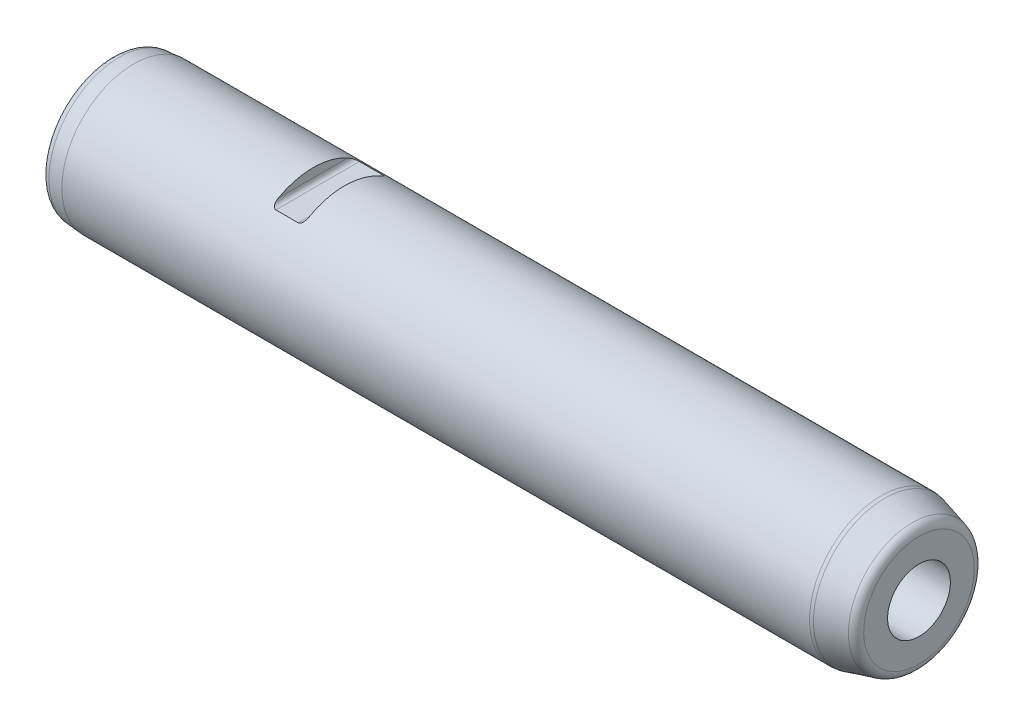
ISO-10303-21;
HEADER;
FILE_DESCRIPTION(('STEP AP214'),'2;1');
FILE_NAME('part.step','',(''),(''),'','','');
FILE_SCHEMA(('AUTOMOTIVE_DESIGN { 1 0 10303 214 1 1 1 1 }'));
ENDSEC;
DATA;
#1=APPLICATION_CONTEXT('core data for automotive mechanical design processes');
#2=APPLICATION_PROTOCOL_DEFINITION('international standard','automotive_design',2000,#1);
#3=PRODUCT_CONTEXT('',#1,'mechanical');
#4=PRODUCT('Part','Part','',(#3));
#5=PRODUCT_RELATED_PRODUCT_CATEGORY('part','',(#4));
#6=PRODUCT_DEFINITION_FORMATION('','',#4);
#7=PRODUCT_DEFINITION_CONTEXT('part definition',#1,'design');
#8=PRODUCT_DEFINITION('design','',#6,#7);
#9=PRODUCT_DEFINITION_SHAPE('','',#8);
#10=(LENGTH_UNIT() NAMED_UNIT(*) SI_UNIT(.MILLI.,.METRE.));
#11=(NAMED_UNIT(*) PLANE_ANGLE_UNIT() SI_UNIT($,.RADIAN.));
#12=(NAMED_UNIT(*) SI_UNIT($,.STERADIAN.) SOLID_ANGLE_UNIT());
#13=UNCERTAINTY_MEASURE_WITH_UNIT(LENGTH_MEASURE(1.E-05),#10,'distance_accuracy_value','');
#14=(GEOMETRIC_REPRESENTATION_CONTEXT(3) GLOBAL_UNCERTAINTY_ASSIGNED_CONTEXT((#13)) GLOBAL_UNIT_ASSIGNED_CONTEXT((#10,
#11,#12)) REPRESENTATION_CONTEXT('',''));
#15=CARTESIAN_POINT('',(0.,0.,0.));
#16=DIRECTION('',(0.,0.,1.));
#17=DIRECTION('',(1.,0.,0.));
#18=AXIS2_PLACEMENT_3D('',#15,#16,#17);
#19=CARTESIAN_POINT('',(0.,0.,0.));
#20=DIRECTION('',(1.,0.,0.));
#21=DIRECTION('',(0.,0.,-1.));
#22=AXIS2_PLACEMENT_3D('',#19,#20,#21);
#23=PLANE('',#22);
#24=CARTESIAN_POINT('',(0.,0.,0.));
#25=DIRECTION('',(1.,0.,0.));
#26=DIRECTION('',(0.,0.,-1.));
#27=AXIS2_PLACEMENT_3D('',#24,#25,#26);
#28=CIRCLE('',#27,13.7298943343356);
#29=CARTESIAN_POINT('',(0.,0.,-13.7298943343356));
#30=VERTEX_POINT('',#29);
#31=EDGE_CURVE('E158',#30,#30,#28,.F.);
#32=ORIENTED_EDGE('',*,*,#31,.T.);
#33=EDGE_LOOP('',(#32));
#34=FACE_BOUND('',#33,.T.);
#35=ADVANCED_FACE('F15',(#34),#23,.F.);
#36=CARTESIAN_POINT('',(0.,0.,0.));
#37=DIRECTION('',(-1.,0.,0.));
#38=DIRECTION('',(0.,0.,1.));
#39=AXIS2_PLACEMENT_3D('',#36,#37,#38);
#40=CYLINDRICAL_SURFACE('',#39,16.);
#41=CARTESIAN_POINT('',(52.,0.,0.));
#42=DIRECTION('',(1.,0.,0.));
#43=DIRECTION('',(0.,1.,0.));
#44=AXIS2_PLACEMENT_3D('',#41,#42,#43);
#45=CIRCLE('',#44,16.);
#46=CARTESIAN_POINT('',(52.,14.,-7.74596669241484));
#47=VERTEX_POINT('',#46);
#48=CARTESIAN_POINT('',(52.,14.,7.74596669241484));
#49=VERTEX_POINT('',#48);
#50=EDGE_CURVE('E9',#47,#49,#45,.T.);
#51=ORIENTED_EDGE('',*,*,#50,.T.);
#52=CARTESIAN_POINT('',(52.,14.,7.74596669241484));
#53=CARTESIAN_POINT('',(51.9999650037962,13.959348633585,7.819449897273));
#54=CARTESIAN_POINT('',(51.9975167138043,13.9180874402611,7.89264943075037));
#55=CARTESIAN_POINT('',(51.9871135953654,13.8344399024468,8.03836515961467));
#56=CARTESIAN_POINT('',(51.9791381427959,13.7920499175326,8.11087776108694));
#57=CARTESIAN_POINT('',(51.9569051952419,13.7062168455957,8.25510297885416));
#58=CARTESIAN_POINT('',(51.9425995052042,13.662768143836,8.32680504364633));
#59=CARTESIAN_POINT('',(51.9067194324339,13.5756417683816,8.46810565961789));
#60=CARTESIAN_POINT('',(51.8851577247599,13.531964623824,8.53770764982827));
#61=CARTESIAN_POINT('',(51.8398944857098,13.4559301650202,8.65688275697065));
#62=CARTESIAN_POINT('',(51.8180806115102,13.4234768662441,8.70710713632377));
#63=CARTESIAN_POINT('',(51.7688619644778,13.3593077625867,8.80524414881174));
#64=CARTESIAN_POINT('',(51.741460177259,13.3275915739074,8.8531579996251));
#65=CARTESIAN_POINT('',(51.6798939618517,13.2653716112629,8.94612033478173));
#66=CARTESIAN_POINT('',(51.6456746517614,13.2348802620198,8.99114136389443));
#67=CARTESIAN_POINT('',(51.5695471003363,13.1766499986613,9.07626213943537));
#68=CARTESIAN_POINT('',(51.5276529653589,13.1489061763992,9.11637069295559));
#69=CARTESIAN_POINT('',(51.4514665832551,13.1070562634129,9.17637827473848));
#70=CARTESIAN_POINT('',(51.4196428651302,13.0915748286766,9.19843836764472));
#71=CARTESIAN_POINT('',(51.3523139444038,13.0634095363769,9.23839413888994));
#72=CARTESIAN_POINT('',(51.3168122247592,13.0507230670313,9.25629370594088));
#73=CARTESIAN_POINT('',(51.2479575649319,13.0306662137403,9.28450292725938));
#74=CARTESIAN_POINT('',(51.2150536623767,13.0227889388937,9.29554087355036));
#75=CARTESIAN_POINT('',(51.1474570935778,13.0103389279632,9.31295862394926));
#76=CARTESIAN_POINT('',(51.112768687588,13.0057586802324,9.31934901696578));
#77=CARTESIAN_POINT('',(51.0648192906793,13.0020184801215,9.32456526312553));
#78=CARTESIAN_POINT('',(51.0518881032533,13.0012626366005,9.32561904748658));
#79=CARTESIAN_POINT('',(51.0259733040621,13.0002535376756,9.32702571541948));
#80=CARTESIAN_POINT('',(51.0129897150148,13.0000000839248,9.32737887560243));
#81=CARTESIAN_POINT('',(51.,13.,9.32737905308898));
#82=B_SPLINE_CURVE_WITH_KNOTS('',3,(#52,#53,#54,#55,#56,#57,#58,#59,#60,#61,#62,#63,#64,#65,#66,
#67,#68,#69,#70,#71,#72,#73,#74,#75,#76,#77,#78,#79,#80,#81),.UNSPECIFIED.,.F.,.F.,(4,2,2,2,2,2,
2,2,2,2,2,2,2,2,4),(0.,0.251969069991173,0.504883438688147,0.759757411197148,1.01418845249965,
1.20491147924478,1.39553286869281,1.58775575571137,1.77962881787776,1.90437141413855,
2.02899694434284,2.13533636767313,2.24143274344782,2.28039798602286,2.31934784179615),.UNSPECIFIED.);
#83=CARTESIAN_POINT('',(51.,13.,9.32737905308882));
#84=VERTEX_POINT('',#83);
#85=EDGE_CURVE('E23',#49,#84,#82,.T.);
#86=ORIENTED_EDGE('',*,*,#85,.T.);
#87=DIRECTION('',(-1.,0.,0.));
#88=VECTOR('',#87,1.);
#89=CARTESIAN_POINT('',(0.,13.,9.32737905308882));
#90=LINE('',#89,#88);
#91=CARTESIAN_POINT('',(46.,13.,9.32737905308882));
#92=VERTEX_POINT('',#91);
#93=EDGE_CURVE('E72',#84,#92,#90,.T.);
#94=ORIENTED_EDGE('',*,*,#93,.T.);
#95=CARTESIAN_POINT('',(46.,13.,9.32737905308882));
#96=CARTESIAN_POINT('',(45.9799324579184,12.9999961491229,9.32738383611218));
#97=CARTESIAN_POINT('',(45.9598798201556,13.0006046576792,9.32653635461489));
#98=CARTESIAN_POINT('',(45.9200086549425,13.0030052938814,9.32318936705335));
#99=CARTESIAN_POINT('',(45.9001898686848,13.0047959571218,9.3206919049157));
#100=CARTESIAN_POINT('',(45.8418152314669,13.011821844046,9.31088386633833));
#101=CARTESIAN_POINT('',(45.8038215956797,13.0187132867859,9.30125462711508));
#102=CARTESIAN_POINT('',(45.7307659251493,13.0361925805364,9.27673989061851));
#103=CARTESIAN_POINT('',(45.6956913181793,13.0467634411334,9.26187855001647));
#104=CARTESIAN_POINT('',(45.6286537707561,13.070820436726,9.22789733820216));
#105=CARTESIAN_POINT('',(45.5967012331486,13.0843158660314,9.20876388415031));
#106=CARTESIAN_POINT('',(45.5199501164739,13.1212427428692,9.15611757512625));
#107=CARTESIAN_POINT('',(45.4773927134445,13.146133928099,9.12037915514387));
#108=CARTESIAN_POINT('',(45.3995111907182,13.1989778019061,9.04373623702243));
#109=CARTESIAN_POINT('',(45.3642009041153,13.2269361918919,9.00282209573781));
#110=CARTESIAN_POINT('',(45.3053550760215,13.2797543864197,8.92468269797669));
#111=CARTESIAN_POINT('',(45.2808380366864,13.3043420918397,8.88799816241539));
#112=CARTESIAN_POINT('',(45.2356844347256,13.3542801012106,8.81278890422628));
#113=CARTESIAN_POINT('',(45.2150505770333,13.3796309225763,8.77426292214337));
#114=CARTESIAN_POINT('',(45.1581485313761,13.4565126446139,8.65627298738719));
#115=CARTESIAN_POINT('',(45.1270873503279,13.5086739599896,8.57468996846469));
#116=CARTESIAN_POINT('',(45.0831650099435,13.5985404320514,8.43118037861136));
#117=CARTESIAN_POINT('',(45.0676476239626,13.636273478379,8.37002305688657));
#118=CARTESIAN_POINT('',(45.0417222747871,13.7114092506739,8.24636190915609));
#119=CARTESIAN_POINT('',(45.0313182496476,13.7488117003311,8.18385708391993));
#120=CARTESIAN_POINT('',(45.0152067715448,13.8223107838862,8.05908620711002));
#121=CARTESIAN_POINT('',(45.0094158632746,13.8584187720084,7.99683719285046));
#122=CARTESIAN_POINT('',(45.0018253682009,13.9298299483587,7.87178697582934));
#123=CARTESIAN_POINT('',(45.0000184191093,13.9651345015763,7.80898700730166));
#124=CARTESIAN_POINT('',(45.,14.,7.74596669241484));
#125=B_SPLINE_CURVE_WITH_KNOTS('',3,(#95,#96,#97,#98,#99,#100,#101,#102,#103,#104,#105,#106,
#107,#108,#109,#110,#111,#112,#113,#114,#115,#116,#117,#118,#119,#120,#121,#122,#123,#124),
.UNSPECIFIED.,.F.,.F.,(4,2,2,2,2,2,2,2,2,2,2,2,2,2,4),(0.,0.0601479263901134,0.120221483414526,
0.238838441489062,0.356914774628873,0.475372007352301,0.657026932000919,0.839025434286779,
0.990345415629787,1.141770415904,1.44583818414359,1.66622637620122,1.88678403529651,
2.10325475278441,2.31932509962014),.UNSPECIFIED.);
#126=CARTESIAN_POINT('',(45.,14.,7.74596669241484));
#127=VERTEX_POINT('',#126);
#128=EDGE_CURVE('E64',#92,#127,#125,.T.);
#129=ORIENTED_EDGE('',*,*,#128,.T.);
#130=CARTESIAN_POINT('',(45.,0.,0.));
#131=DIRECTION('',(-1.,0.,0.));
#132=DIRECTION('',(0.,0.,1.));
#133=AXIS2_PLACEMENT_3D('',#130,#131,#132);
#134=CIRCLE('',#133,16.);
#135=CARTESIAN_POINT('',(45.,14.,-7.74596669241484));
#136=VERTEX_POINT('',#135);
#137=EDGE_CURVE('E53',#127,#136,#134,.T.);
#138=ORIENTED_EDGE('',*,*,#137,.T.);
#139=CARTESIAN_POINT('',(45.,14.,-7.74596669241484));
#140=CARTESIAN_POINT('',(45.0000349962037,13.959348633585,-7.819449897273));
#141=CARTESIAN_POINT('',(45.0024832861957,13.9180874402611,-7.89264943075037));
#142=CARTESIAN_POINT('',(45.0128864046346,13.8344399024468,-8.03836515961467));
#143=CARTESIAN_POINT('',(45.0208618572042,13.7920499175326,-8.11087776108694));
#144=CARTESIAN_POINT('',(45.0430948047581,13.7062168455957,-8.25510297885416));
#145=CARTESIAN_POINT('',(45.0574004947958,13.662768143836,-8.32680504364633));
#146=CARTESIAN_POINT('',(45.0932805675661,13.5756417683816,-8.46810565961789));
#147=CARTESIAN_POINT('',(45.1148422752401,13.531964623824,-8.53770764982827));
#148=CARTESIAN_POINT('',(45.1601055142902,13.4559301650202,-8.65688275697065));
#149=CARTESIAN_POINT('',(45.1819193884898,13.4234768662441,-8.70710713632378));
#150=CARTESIAN_POINT('',(45.2311380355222,13.3593077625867,-8.80524414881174));
#151=CARTESIAN_POINT('',(45.258539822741,13.3275915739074,-8.8531579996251));
#152=CARTESIAN_POINT('',(45.3201060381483,13.2653716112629,-8.94612033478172));
#153=CARTESIAN_POINT('',(45.3543253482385,13.2348802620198,-8.99114136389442));
#154=CARTESIAN_POINT('',(45.4304528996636,13.1766499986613,-9.07626213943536));
#155=CARTESIAN_POINT('',(45.4723470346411,13.1489061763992,-9.11637069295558));
#156=CARTESIAN_POINT('',(45.5485334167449,13.1070562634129,-9.17637827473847));
#157=CARTESIAN_POINT('',(45.5803571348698,13.0915748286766,-9.19843836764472));
#158=CARTESIAN_POINT('',(45.6476860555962,13.0634095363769,-9.23839413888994));
#159=CARTESIAN_POINT('',(45.6831877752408,13.0507230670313,-9.25629370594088));
#160=CARTESIAN_POINT('',(45.7520424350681,13.0306662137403,-9.28450292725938));
#161=CARTESIAN_POINT('',(45.7849463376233,13.0227889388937,-9.29554087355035));
#162=CARTESIAN_POINT('',(45.8525429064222,13.0103389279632,-9.31295862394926));
#163=CARTESIAN_POINT('',(45.887231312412,13.0057586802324,-9.31934901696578));
#164=CARTESIAN_POINT('',(45.9351807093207,13.0020184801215,-9.32456526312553));
#165=CARTESIAN_POINT('',(45.9481118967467,13.0012626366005,-9.32561904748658));
#166=CARTESIAN_POINT('',(45.9740266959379,13.0002535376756,-9.32702571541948));
#167=CARTESIAN_POINT('',(45.9870102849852,13.0000000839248,-9.32737887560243));
#168=CARTESIAN_POINT('',(46.,13.,-9.32737905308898));
#169=B_SPLINE_CURVE_WITH_KNOTS('',3,(#139,#140,#141,#142,#143,#144,#145,#146,#147,#148,#149,
#150,#151,#152,#153,#154,#155,#156,#157,#158,#159,#160,#161,#162,#163,#164,#165,#166,#167,#168),
.UNSPECIFIED.,.F.,.F.,(4,2,2,2,2,2,2,2,2,2,2,2,2,2,4),(0.,0.251969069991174,0.504883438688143,
0.759757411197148,1.01418845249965,1.20491147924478,1.39553286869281,1.58775575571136,
1.77962881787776,1.90437141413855,2.02899694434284,2.13533636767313,2.24143274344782,
2.28039798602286,2.31934784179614),.UNSPECIFIED.);
#170=CARTESIAN_POINT('',(46.,13.,-9.32737905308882));
#171=VERTEX_POINT('',#170);
#172=EDGE_CURVE('E58',#136,#171,#169,.T.);
#173=ORIENTED_EDGE('',*,*,#172,.T.);
#174=DIRECTION('',(-1.,0.,0.));
#175=VECTOR('',#174,1.);
#176=CARTESIAN_POINT('',(0.,13.,-9.32737905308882));
#177=LINE('',#176,#175);
#178=CARTESIAN_POINT('',(51.,13.,-9.32737905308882));
#179=VERTEX_POINT('',#178);
#180=EDGE_CURVE('E73',#171,#179,#177,.F.);
#181=ORIENTED_EDGE('',*,*,#180,.T.);
#182=CARTESIAN_POINT('',(51.,13.,-9.32737905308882));
#183=CARTESIAN_POINT('',(51.0200675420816,12.9999961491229,-9.32738383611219));
#184=CARTESIAN_POINT('',(51.0401201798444,13.0006046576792,-9.3265363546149));
#185=CARTESIAN_POINT('',(51.0799913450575,13.0030052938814,-9.32318936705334));
#186=CARTESIAN_POINT('',(51.0998101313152,13.0047959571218,-9.32069190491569));
#187=CARTESIAN_POINT('',(51.1581847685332,13.011821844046,-9.31088386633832));
#188=CARTESIAN_POINT('',(51.1961784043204,13.0187132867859,-9.30125462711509));
#189=CARTESIAN_POINT('',(51.2692340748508,13.0361925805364,-9.27673989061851));
#190=CARTESIAN_POINT('',(51.3043086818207,13.0467634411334,-9.26187855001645));
#191=CARTESIAN_POINT('',(51.3713462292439,13.070820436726,-9.22789733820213));
#192=CARTESIAN_POINT('',(51.4032987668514,13.0843158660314,-9.2087638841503));
#193=CARTESIAN_POINT('',(51.4800498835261,13.1212427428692,-9.15611757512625));
#194=CARTESIAN_POINT('',(51.5226072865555,13.146133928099,-9.12037915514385));
#195=CARTESIAN_POINT('',(51.6004888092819,13.1989778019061,-9.04373623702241));
#196=CARTESIAN_POINT('',(51.6357990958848,13.2269361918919,-9.00282209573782));
#197=CARTESIAN_POINT('',(51.6946449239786,13.2797543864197,-8.92468269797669));
#198=CARTESIAN_POINT('',(51.7191619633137,13.3043420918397,-8.88799816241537));
#199=CARTESIAN_POINT('',(51.7643155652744,13.3542801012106,-8.81278890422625));
#200=CARTESIAN_POINT('',(51.7849494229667,13.3796309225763,-8.77426292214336));
#201=CARTESIAN_POINT('',(51.8418514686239,13.4565126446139,-8.6562729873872));
#202=CARTESIAN_POINT('',(51.8729126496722,13.5086739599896,-8.5746899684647));
#203=CARTESIAN_POINT('',(51.9168349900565,13.5985404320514,-8.43118037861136));
#204=CARTESIAN_POINT('',(51.9323523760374,13.636273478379,-8.37002305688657));
#205=CARTESIAN_POINT('',(51.9582777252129,13.7114092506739,-8.24636190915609));
#206=CARTESIAN_POINT('',(51.9686817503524,13.7488117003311,-8.18385708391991));
#207=CARTESIAN_POINT('',(51.9847932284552,13.8223107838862,-8.05908620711));
#208=CARTESIAN_POINT('',(51.9905841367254,13.8584187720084,-7.99683719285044));
#209=CARTESIAN_POINT('',(51.9981746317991,13.9298299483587,-7.87178697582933));
#210=CARTESIAN_POINT('',(51.9999815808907,13.9651345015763,-7.80898700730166));
#211=CARTESIAN_POINT('',(52.,14.,-7.74596669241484));
#212=B_SPLINE_CURVE_WITH_KNOTS('',3,(#182,#183,#184,#185,#186,#187,#188,#189,#190,#191,#192,
#193,#194,#195,#196,#197,#198,#199,#200,#201,#202,#203,#204,#205,#206,#207,#208,#209,#210,#211),
.UNSPECIFIED.,.F.,.F.,(4,2,2,2,2,2,2,2,2,2,2,2,2,2,4),(0.,0.0601479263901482,0.12022148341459,
0.238838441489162,0.356914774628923,0.475372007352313,0.65702693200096,0.839025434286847,
0.990345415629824,1.14177041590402,1.44583818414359,1.66622637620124,1.88678403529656,
2.10325475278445,2.31932509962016),.UNSPECIFIED.);
#213=EDGE_CURVE('E207',#179,#47,#212,.T.);
#214=ORIENTED_EDGE('',*,*,#213,.T.);
#215=EDGE_LOOP('',(#51,#86,#94,#129,#138,#173,#181,#214));
#216=FACE_BOUND('',#215,.T.);
#217=CARTESIAN_POINT('',(4.99999999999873,0.,0.));
#218=DIRECTION('',(1.,0.,0.));
#219=DIRECTION('',(0.,0.,-1.));
#220=AXIS2_PLACEMENT_3D('',#217,#218,#219);
#221=CIRCLE('',#220,16.);
#222=CARTESIAN_POINT('',(4.99999999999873,0.,-16.));
#223=VERTEX_POINT('',#222);
#224=EDGE_CURVE('E157',#223,#223,#221,.T.);
#225=ORIENTED_EDGE('',*,*,#224,.T.);
#226=EDGE_LOOP('',(#225));
#227=FACE_BOUND('',#226,.T.);
#228=CARTESIAN_POINT('',(171.605042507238,0.,0.));
#229=DIRECTION('',(1.,0.,0.));
#230=DIRECTION('',(0.,0.,-1.));
#231=AXIS2_PLACEMENT_3D('',#228,#229,#230);
#232=CIRCLE('',#231,16.);
#233=CARTESIAN_POINT('',(171.605042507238,0.,-16.));
#234=VERTEX_POINT('',#233);
#235=EDGE_CURVE('E175',#234,#234,#232,.F.);
#236=ORIENTED_EDGE('',*,*,#235,.T.);
#237=EDGE_LOOP('',(#236));
#238=FACE_BOUND('',#237,.T.);
#239=ADVANCED_FACE('F69',(#216,#227,#238),#40,.T.);
#240=CARTESIAN_POINT('',(180.,0.,0.));
#241=DIRECTION('',(-1.,0.,0.));
#242=DIRECTION('',(0.,0.,1.));
#243=AXIS2_PLACEMENT_3D('',#240,#241,#242);
#244=CONICAL_SURFACE('',#243,13.856406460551,0.26179938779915);
#245=CARTESIAN_POINT('',(178.517638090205,0.,0.));
#246=DIRECTION('',(1.,0.,0.));
#247=DIRECTION('',(0.,0.,-1.));
#248=AXIS2_PLACEMENT_3D('',#245,#246,#247);
#249=CIRCLE('',#248,14.2536041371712);
#250=CARTESIAN_POINT('',(178.517638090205,0.,-14.2536041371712));
#251=VERTEX_POINT('',#250);
#252=EDGE_CURVE('E163',#251,#251,#249,.F.);
#253=ORIENTED_EDGE('',*,*,#252,.T.);
#254=EDGE_LOOP('',(#253));
#255=FACE_BOUND('',#254,.T.);
#256=CARTESIAN_POINT('',(172.381499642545,0.,0.));
#257=DIRECTION('',(1.,0.,0.));
#258=DIRECTION('',(0.,0.,-1.));
#259=AXIS2_PLACEMENT_3D('',#256,#257,#258);
#260=CIRCLE('',#259,15.8977774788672);
#261=CARTESIAN_POINT('',(172.381499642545,0.,-15.8977774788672));
#262=VERTEX_POINT('',#261);
#263=EDGE_CURVE('E188',#262,#262,#260,.T.);
#264=ORIENTED_EDGE('',*,*,#263,.T.);
#265=EDGE_LOOP('',(#264));
#266=FACE_BOUND('',#265,.T.);
#267=ADVANCED_FACE('F120',(#255,#266),#244,.T.);
#268=CARTESIAN_POINT('',(180.,13.856406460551,0.));
#269=DIRECTION('',(-1.,0.,0.));
#270=DIRECTION('',(0.,0.,1.));
#271=AXIS2_PLACEMENT_3D('',#268,#269,#270);
#272=PLANE('',#271);
#273=CARTESIAN_POINT('',(180.,0.,0.));
#274=DIRECTION('',(1.,0.,0.));
#275=DIRECTION('',(0.,0.,-1.));
#276=AXIS2_PLACEMENT_3D('',#273,#274,#275);
#277=CIRCLE('',#276,7.);
#278=CARTESIAN_POINT('',(180.,0.,-7.));
#279=VERTEX_POINT('',#278);
#280=EDGE_CURVE('E178',#279,#279,#277,.T.);
#281=ORIENTED_EDGE('',*,*,#280,.F.);
#282=EDGE_LOOP('',(#281));
#283=FACE_BOUND('',#282,.T.);
#284=CARTESIAN_POINT('',(180.,0.,0.));
#285=DIRECTION('',(-1.,0.,0.));
#286=DIRECTION('',(0.,0.,1.));
#287=AXIS2_PLACEMENT_3D('',#284,#285,#286);
#288=CIRCLE('',#287,12.3217524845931);
#289=CARTESIAN_POINT('',(180.,0.,12.3217524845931));
#290=VERTEX_POINT('',#289);
#291=EDGE_CURVE('E159',#290,#290,#288,.F.);
#292=ORIENTED_EDGE('',*,*,#291,.T.);
#293=EDGE_LOOP('',(#292));
#294=FACE_BOUND('',#293,.T.);
#295=ADVANCED_FACE('F117',(#283,#294),#272,.F.);
#296=CARTESIAN_POINT('',(171.605042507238,0.,0.));
#297=DIRECTION('',(1.,0.,0.));
#298=DIRECTION('',(0.,0.,-1.));
#299=AXIS2_PLACEMENT_3D('',#296,#297,#298);
#300=TOROIDAL_SURFACE('',#299,13.,3.);
#301=ORIENTED_EDGE('',*,*,#263,.F.);
#302=EDGE_LOOP('',(#301));
#303=FACE_BOUND('',#302,.T.);
#304=ORIENTED_EDGE('',*,*,#235,.F.);
#305=EDGE_LOOP('',(#304));
#306=FACE_BOUND('',#305,.T.);
#307=ADVANCED_FACE('F119',(#303,#306),#300,.T.);
#308=CARTESIAN_POINT('',(178.,0.,0.));
#309=DIRECTION('',(-1.,0.,0.));
#310=DIRECTION('',(0.,0.,1.));
#311=AXIS2_PLACEMENT_3D('',#308,#309,#310);
#312=TOROIDAL_SURFACE('',#311,12.3217524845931,2.);
#313=ORIENTED_EDGE('',*,*,#291,.F.);
#314=EDGE_LOOP('',(#313));
#315=FACE_BOUND('',#314,.T.);
#316=ORIENTED_EDGE('',*,*,#252,.F.);
#317=EDGE_LOOP('',(#316));
#318=FACE_BOUND('',#317,.T.);
#319=ADVANCED_FACE('F140',(#315,#318),#312,.T.);
#320=CARTESIAN_POINT('',(0.,0.,0.));
#321=DIRECTION('',(1.,0.,0.));
#322=DIRECTION('',(0.,0.,-1.));
#323=AXIS2_PLACEMENT_3D('',#320,#321,#322);
#324=CONICAL_SURFACE('',#323,15.5625566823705,0.0872664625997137);
#325=CARTESIAN_POINT('',(1.82568851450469,0.,0.));
#326=DIRECTION('',(1.,0.,0.));
#327=DIRECTION('',(0.,0.,-1.));
#328=AXIS2_PLACEMENT_3D('',#325,#326,#327);
#329=CIRCLE('',#328,15.7222837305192);
#330=CARTESIAN_POINT('',(1.82568851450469,0.,-15.7222837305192));
#331=VERTEX_POINT('',#330);
#332=EDGE_CURVE('E59',#331,#331,#329,.T.);
#333=ORIENTED_EDGE('',*,*,#332,.T.);
#334=EDGE_LOOP('',(#333));
#335=FACE_BOUND('',#334,.T.);
#336=ORIENTED_EDGE('',*,*,#224,.F.);
#337=EDGE_LOOP('',(#336));
#338=FACE_BOUND('',#337,.T.);
#339=ADVANCED_FACE('F143',(#335,#338),#324,.T.);
#340=CARTESIAN_POINT('',(2.,0.,0.));
#341=DIRECTION('',(1.,0.,0.));
#342=DIRECTION('',(0.,0.,-1.));
#343=AXIS2_PLACEMENT_3D('',#340,#341,#342);
#344=TOROIDAL_SURFACE('',#343,13.7298943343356,2.);
#345=ORIENTED_EDGE('',*,*,#332,.F.);
#346=EDGE_LOOP('',(#345));
#347=FACE_BOUND('',#346,.T.);
#348=ORIENTED_EDGE('',*,*,#31,.F.);
#349=EDGE_LOOP('',(#348));
#350=FACE_BOUND('',#349,.T.);
#351=ADVANCED_FACE('F17',(#347,#350),#344,.T.);
#352=CARTESIAN_POINT('',(156.,0.,0.));
#353=DIRECTION('',(1.,0.,0.));
#354=DIRECTION('',(0.,0.,-1.));
#355=AXIS2_PLACEMENT_3D('',#352,#353,#354);
#356=PLANE('',#355);
#357=CARTESIAN_POINT('',(156.,0.,0.));
#358=DIRECTION('',(1.,0.,0.));
#359=DIRECTION('',(0.,0.,-1.));
#360=AXIS2_PLACEMENT_3D('',#357,#358,#359);
#361=CIRCLE('',#360,7.);
#362=CARTESIAN_POINT('',(156.,0.,-7.));
#363=VERTEX_POINT('',#362);
#364=EDGE_CURVE('E171',#363,#363,#361,.T.);
#365=ORIENTED_EDGE('',*,*,#364,.T.);
#366=EDGE_LOOP('',(#365));
#367=FACE_BOUND('',#366,.T.);
#368=CARTESIAN_POINT('',(156.,0.,0.));
#369=DIRECTION('',(1.,0.,0.));
#370=DIRECTION('',(0.,0.,-1.));
#371=AXIS2_PLACEMENT_3D('',#368,#369,#370);
#372=CIRCLE('',#371,5.1);
#373=CARTESIAN_POINT('',(156.,0.,-5.1));
#374=VERTEX_POINT('',#373);
#375=EDGE_CURVE('E168',#374,#374,#372,.F.);
#376=ORIENTED_EDGE('',*,*,#375,.T.);
#377=EDGE_LOOP('',(#376));
#378=FACE_BOUND('',#377,.T.);
#379=ADVANCED_FACE('F101',(#367,#378),#356,.T.);
#380=CARTESIAN_POINT('',(156.,0.,0.));
#381=DIRECTION('',(1.,0.,0.));
#382=DIRECTION('',(0.,0.,-1.));
#383=AXIS2_PLACEMENT_3D('',#380,#381,#382);
#384=CYLINDRICAL_SURFACE('',#383,7.);
#385=ORIENTED_EDGE('',*,*,#364,.F.);
#386=EDGE_LOOP('',(#385));
#387=FACE_BOUND('',#386,.T.);
#388=ORIENTED_EDGE('',*,*,#280,.T.);
#389=EDGE_LOOP('',(#388));
#390=FACE_BOUND('',#389,.T.);
#391=ADVANCED_FACE('F104',(#387,#390),#384,.F.);
#392=CARTESIAN_POINT('',(150.,0.,0.));
#393=DIRECTION('',(1.,0.,0.));
#394=DIRECTION('',(0.,0.,-1.));
#395=AXIS2_PLACEMENT_3D('',#392,#393,#394);
#396=CONICAL_SURFACE('',#395,5.1,1.0471975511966);
#397=CARTESIAN_POINT('',(147.055513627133,0.,0.));
#398=VERTEX_POINT('',#397);
#399=VERTEX_LOOP('',#398);
#400=FACE_BOUND('',#399,.T.);
#401=CARTESIAN_POINT('',(150.,0.,0.));
#402=DIRECTION('',(1.,0.,0.));
#403=DIRECTION('',(0.,0.,-1.));
#404=AXIS2_PLACEMENT_3D('',#401,#402,#403);
#405=CIRCLE('',#404,5.1);
#406=CARTESIAN_POINT('',(150.,0.,-5.1));
#407=VERTEX_POINT('',#406);
#408=EDGE_CURVE('E170',#407,#407,#405,.T.);
#409=ORIENTED_EDGE('',*,*,#408,.T.);
#410=EDGE_LOOP('',(#409));
#411=FACE_BOUND('',#410,.T.);
#412=ADVANCED_FACE('F108',(#400,#411),#396,.F.);
#413=CARTESIAN_POINT('',(180.,0.,0.));
#414=DIRECTION('',(1.,0.,0.));
#415=DIRECTION('',(0.,0.,-1.));
#416=AXIS2_PLACEMENT_3D('',#413,#414,#415);
#417=CYLINDRICAL_SURFACE('',#416,5.1);
#418=ORIENTED_EDGE('',*,*,#408,.F.);
#419=EDGE_LOOP('',(#418));
#420=FACE_BOUND('',#419,.T.);
#421=ORIENTED_EDGE('',*,*,#375,.F.);
#422=EDGE_LOOP('',(#421));
#423=FACE_BOUND('',#422,.T.);
#424=ADVANCED_FACE('F110',(#420,#423),#417,.F.);
#425=CARTESIAN_POINT('',(52.,14.,-16.));
#426=DIRECTION('',(1.,0.,0.));
#427=DIRECTION('',(0.,1.,0.));
#428=AXIS2_PLACEMENT_3D('',#425,#426,#427);
#429=PLANE('',#428);
#430=ORIENTED_EDGE('',*,*,#50,.F.);
#431=DIRECTION('',(0.,0.,1.));
#432=VECTOR('',#431,1.);
#433=CARTESIAN_POINT('',(52.,14.,-16.));
#434=LINE('',#433,#432);
#435=EDGE_CURVE('E182',#47,#49,#434,.T.);
#436=ORIENTED_EDGE('',*,*,#435,.T.);
#437=EDGE_LOOP('',(#430,#436));
#438=FACE_BOUND('',#437,.T.);
#439=ADVANCED_FACE('F113',(#438),#429,.F.);
#440=CARTESIAN_POINT('',(51.,14.,-16.));
#441=DIRECTION('',(0.,0.,1.));
#442=DIRECTION('',(1.,0.,0.));
#443=AXIS2_PLACEMENT_3D('',#440,#441,#442);
#444=CYLINDRICAL_SURFACE('',#443,1.);
#445=ORIENTED_EDGE('',*,*,#435,.F.);
#446=ORIENTED_EDGE('',*,*,#213,.F.);
#447=DIRECTION('',(0.,0.,1.));
#448=VECTOR('',#447,1.);
#449=CARTESIAN_POINT('',(51.,13.,-16.));
#450=LINE('',#449,#448);
#451=EDGE_CURVE('E197',#179,#84,#450,.T.);
#452=ORIENTED_EDGE('',*,*,#451,.T.);
#453=ORIENTED_EDGE('',*,*,#85,.F.);
#454=EDGE_LOOP('',(#445,#446,#452,#453));
#455=FACE_BOUND('',#454,.T.);
#456=ADVANCED_FACE('F206',(#455),#444,.F.);
#457=CARTESIAN_POINT('',(46.,13.,-16.));
#458=DIRECTION('',(0.,-1.,0.));
#459=DIRECTION('',(0.,0.,-1.));
#460=AXIS2_PLACEMENT_3D('',#457,#458,#459);
#461=PLANE('',#460);
#462=ORIENTED_EDGE('',*,*,#451,.F.);
#463=ORIENTED_EDGE('',*,*,#180,.F.);
#464=DIRECTION('',(0.,0.,1.));
#465=VECTOR('',#464,1.);
#466=CARTESIAN_POINT('',(46.,13.,-16.));
#467=LINE('',#466,#465);
#468=EDGE_CURVE('E66',#171,#92,#467,.T.);
#469=ORIENTED_EDGE('',*,*,#468,.T.);
#470=ORIENTED_EDGE('',*,*,#93,.F.);
#471=EDGE_LOOP('',(#462,#463,#469,#470));
#472=FACE_BOUND('',#471,.T.);
#473=ADVANCED_FACE('F96',(#472),#461,.F.);
#474=CARTESIAN_POINT('',(46.,14.,-16.));
#475=DIRECTION('',(0.,0.,1.));
#476=DIRECTION('',(1.,0.,0.));
#477=AXIS2_PLACEMENT_3D('',#474,#475,#476);
#478=CYLINDRICAL_SURFACE('',#477,1.);
#479=ORIENTED_EDGE('',*,*,#468,.F.);
#480=ORIENTED_EDGE('',*,*,#172,.F.);
#481=DIRECTION('',(0.,0.,1.));
#482=VECTOR('',#481,1.);
#483=CARTESIAN_POINT('',(45.,14.,-16.));
#484=LINE('',#483,#482);
#485=EDGE_CURVE('E29',#136,#127,#484,.T.);
#486=ORIENTED_EDGE('',*,*,#485,.T.);
#487=ORIENTED_EDGE('',*,*,#128,.F.);
#488=EDGE_LOOP('',(#479,#480,#486,#487));
#489=FACE_BOUND('',#488,.T.);
#490=ADVANCED_FACE('F63',(#489),#478,.F.);
#491=CARTESIAN_POINT('',(45.,16.,-16.));
#492=DIRECTION('',(-1.,0.,0.));
#493=DIRECTION('',(0.,0.,1.));
#494=AXIS2_PLACEMENT_3D('',#491,#492,#493);
#495=PLANE('',#494);
#496=ORIENTED_EDGE('',*,*,#485,.F.);
#497=ORIENTED_EDGE('',*,*,#137,.F.);
#498=EDGE_LOOP('',(#496,#497));
#499=FACE_BOUND('',#498,.T.);
#500=ADVANCED_FACE('F54',(#499),#495,.F.);
#501=CLOSED_SHELL('',(#35,#239,#267,#295,#307,#319,#339,#351,#379,#391,#412,#424,#439,#456,#473,
#490,#500));
#502=MANIFOLD_SOLID_BREP('B1',#501);
#503=ADVANCED_BREP_SHAPE_REPRESENTATION('',(#18,#502),#14);
#504=SHAPE_DEFINITION_REPRESENTATION(#9,#503);
ENDSEC;
END-ISO-10303-21;
